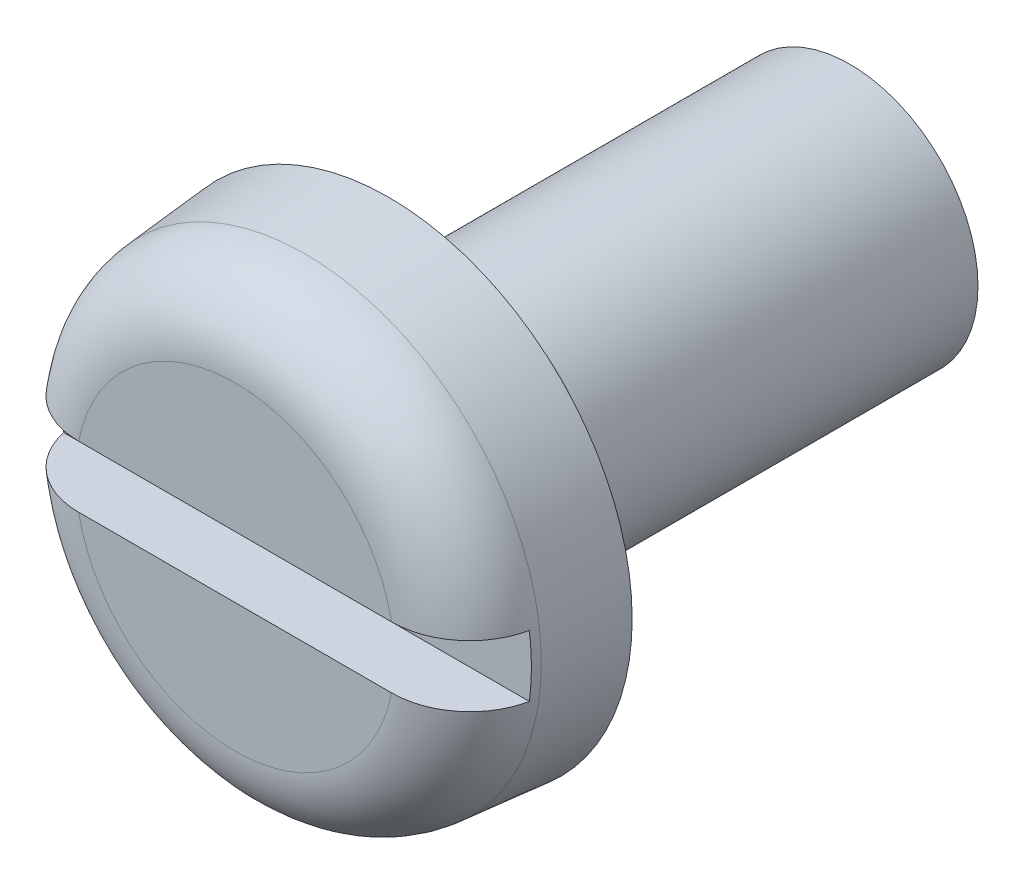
ISO-10303-21;
HEADER;
FILE_DESCRIPTION(('STEP AP214'),'2;1');
FILE_NAME('part.step','',(''),(''),'','','');
FILE_SCHEMA(('AUTOMOTIVE_DESIGN { 1 0 10303 214 1 1 1 1 }'));
ENDSEC;
DATA;
#1=APPLICATION_CONTEXT('core data for automotive mechanical design processes');
#2=APPLICATION_PROTOCOL_DEFINITION('international standard','automotive_design',2000,#1);
#3=PRODUCT_CONTEXT('',#1,'mechanical');
#4=PRODUCT('Part','Part','',(#3));
#5=PRODUCT_RELATED_PRODUCT_CATEGORY('part','',(#4));
#6=PRODUCT_DEFINITION_FORMATION('','',#4);
#7=PRODUCT_DEFINITION_CONTEXT('part definition',#1,'design');
#8=PRODUCT_DEFINITION('design','',#6,#7);
#9=PRODUCT_DEFINITION_SHAPE('','',#8);
#10=(LENGTH_UNIT() NAMED_UNIT(*) SI_UNIT(.MILLI.,.METRE.));
#11=(NAMED_UNIT(*) PLANE_ANGLE_UNIT() SI_UNIT($,.RADIAN.));
#12=(NAMED_UNIT(*) SI_UNIT($,.STERADIAN.) SOLID_ANGLE_UNIT());
#13=UNCERTAINTY_MEASURE_WITH_UNIT(LENGTH_MEASURE(1.E-05),#10,'distance_accuracy_value','');
#14=(GEOMETRIC_REPRESENTATION_CONTEXT(3) GLOBAL_UNCERTAINTY_ASSIGNED_CONTEXT((#13)) GLOBAL_UNIT_ASSIGNED_CONTEXT((#10,
#11,#12)) REPRESENTATION_CONTEXT('',''));
#15=CARTESIAN_POINT('',(0.,0.,0.));
#16=DIRECTION('',(0.,0.,1.));
#17=DIRECTION('',(1.,0.,0.));
#18=AXIS2_PLACEMENT_3D('',#15,#16,#17);
#19=CARTESIAN_POINT('',(0.,0.,-0.2));
#20=DIRECTION('',(0.,0.,1.));
#21=DIRECTION('',(1.,0.,0.));
#22=AXIS2_PLACEMENT_3D('',#19,#20,#21);
#23=TOROIDAL_SURFACE('',#22,2.5,0.2);
#24=CARTESIAN_POINT('',(0.,0.,0.));
#25=DIRECTION('',(0.,0.,1.));
#26=DIRECTION('',(1.,0.,0.));
#27=AXIS2_PLACEMENT_3D('',#24,#25,#26);
#28=CIRCLE('',#27,2.5);
#29=CARTESIAN_POINT('',(2.5,0.,0.));
#30=VERTEX_POINT('',#29);
#31=EDGE_CURVE('E117',#30,#30,#28,.T.);
#32=ORIENTED_EDGE('',*,*,#31,.F.);
#33=EDGE_LOOP('',(#32));
#34=FACE_BOUND('',#33,.T.);
#35=CARTESIAN_POINT('',(0.,0.,-0.228571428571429));
#36=DIRECTION('',(0.,0.,1.));
#37=DIRECTION('',(1.,0.,0.));
#38=AXIS2_PLACEMENT_3D('',#35,#36,#37);
#39=CIRCLE('',#38,2.30205133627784);
#40=CARTESIAN_POINT('',(2.30205133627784,0.,-0.228571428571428));
#41=VERTEX_POINT('',#40);
#42=EDGE_CURVE('E11',#41,#41,#39,.T.);
#43=ORIENTED_EDGE('',*,*,#42,.T.);
#44=EDGE_LOOP('',(#43));
#45=FACE_BOUND('',#44,.T.);
#46=ADVANCED_FACE('F34',(#34,#45),#23,.F.);
#47=CARTESIAN_POINT('',(0.,0.,-1.6));
#48=DIRECTION('',(0.,0.,-1.));
#49=DIRECTION('',(-1.,0.,0.));
#50=AXIS2_PLACEMENT_3D('',#47,#48,#49);
#51=CONICAL_SURFACE('',#50,2.5,0.143347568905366);
#52=ORIENTED_EDGE('',*,*,#42,.F.);
#53=EDGE_LOOP('',(#52));
#54=FACE_BOUND('',#53,.T.);
#55=CARTESIAN_POINT('',(0.,0.,-1.6));
#56=DIRECTION('',(0.,0.,1.));
#57=DIRECTION('',(1.,0.,0.));
#58=AXIS2_PLACEMENT_3D('',#55,#56,#57);
#59=CIRCLE('',#58,2.5);
#60=CARTESIAN_POINT('',(2.5,0.,-1.6));
#61=VERTEX_POINT('',#60);
#62=EDGE_CURVE('E42',#61,#61,#59,.T.);
#63=ORIENTED_EDGE('',*,*,#62,.T.);
#64=EDGE_LOOP('',(#63));
#65=FACE_BOUND('',#64,.T.);
#66=ADVANCED_FACE('F170',(#54,#65),#51,.T.);
#67=CARTESIAN_POINT('',(0.,0.,0.));
#68=DIRECTION('',(0.,0.,1.));
#69=DIRECTION('',(1.,0.,0.));
#70=AXIS2_PLACEMENT_3D('',#67,#68,#69);
#71=CYLINDRICAL_SURFACE('',#70,2.5);
#72=ORIENTED_EDGE('',*,*,#62,.F.);
#73=EDGE_LOOP('',(#72));
#74=FACE_BOUND('',#73,.T.);
#75=CARTESIAN_POINT('',(0.,0.,-9.));
#76=DIRECTION('',(0.,0.,-1.));
#77=DIRECTION('',(-1.,0.,0.));
#78=AXIS2_PLACEMENT_3D('',#75,#76,#77);
#79=CIRCLE('',#78,2.5);
#80=CARTESIAN_POINT('',(-2.5,0.,-9.));
#81=VERTEX_POINT('',#80);
#82=EDGE_CURVE('E161',#81,#81,#79,.T.);
#83=ORIENTED_EDGE('',*,*,#82,.F.);
#84=EDGE_LOOP('',(#83));
#85=FACE_BOUND('',#84,.T.);
#86=ADVANCED_FACE('F167',(#74,#85),#71,.T.);
#87=CARTESIAN_POINT('',(0.,-4.75,0.));
#88=DIRECTION('',(0.,0.,-1.));
#89=DIRECTION('',(-1.,0.,0.));
#90=AXIS2_PLACEMENT_3D('',#87,#88,#89);
#91=PLANE('',#90);
#92=CARTESIAN_POINT('',(0.,0.,0.));
#93=DIRECTION('',(0.,0.,1.));
#94=DIRECTION('',(1.,0.,0.));
#95=AXIS2_PLACEMENT_3D('',#92,#93,#94);
#96=CIRCLE('',#95,4.75);
#97=CARTESIAN_POINT('',(4.75,0.,0.));
#98=VERTEX_POINT('',#97);
#99=EDGE_CURVE('E144',#98,#98,#96,.T.);
#100=ORIENTED_EDGE('',*,*,#99,.F.);
#101=EDGE_LOOP('',(#100));
#102=FACE_BOUND('',#101,.T.);
#103=ORIENTED_EDGE('',*,*,#31,.T.);
#104=EDGE_LOOP('',(#103));
#105=FACE_BOUND('',#104,.T.);
#106=ADVANCED_FACE('F169',(#102,#105),#91,.T.);
#107=CARTESIAN_POINT('',(0.,-3.11303724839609,3.));
#108=DIRECTION('',(0.,0.,-1.));
#109=DIRECTION('',(-1.,0.,0.));
#110=AXIS2_PLACEMENT_3D('',#107,#108,#109);
#111=PLANE('',#110);
#112=CARTESIAN_POINT('',(0.,0.,3.));
#113=DIRECTION('',(0.,0.,1.));
#114=DIRECTION('',(1.,0.,0.));
#115=AXIS2_PLACEMENT_3D('',#112,#113,#114);
#116=CIRCLE('',#115,3.11303724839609);
#117=CARTESIAN_POINT('',(-3.05466870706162,-0.6,3.));
#118=VERTEX_POINT('',#117);
#119=CARTESIAN_POINT('',(3.05466870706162,-0.6,3.));
#120=VERTEX_POINT('',#119);
#121=EDGE_CURVE('E150',#118,#120,#116,.T.);
#122=ORIENTED_EDGE('',*,*,#121,.T.);
#123=DIRECTION('',(1.,0.,0.));
#124=VECTOR('',#123,1.);
#125=CARTESIAN_POINT('',(-4.75,-0.6,3.));
#126=LINE('',#125,#124);
#127=EDGE_CURVE('E65',#118,#120,#126,.T.);
#128=ORIENTED_EDGE('',*,*,#127,.F.);
#129=EDGE_LOOP('',(#122,#128));
#130=FACE_BOUND('',#129,.T.);
#131=ADVANCED_FACE('F177',(#130),#111,.F.);
#132=CARTESIAN_POINT('',(0.,0.,0.));
#133=DIRECTION('',(0.,0.,-1.));
#134=DIRECTION('',(-1.,0.,0.));
#135=AXIS2_PLACEMENT_3D('',#132,#133,#134);
#136=CONICAL_SURFACE('',#135,4.75,0.0872664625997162);
#137=CARTESIAN_POINT('',(0.,0.,1.63073361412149));
#138=DIRECTION('',(0.,0.,1.));
#139=DIRECTION('',(1.,0.,0.));
#140=AXIS2_PLACEMENT_3D('',#137,#138,#139);
#141=CIRCLE('',#140,4.60732929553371);
#142=CARTESIAN_POINT('',(4.60732929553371,0.,1.63073361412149));
#143=VERTEX_POINT('',#142);
#144=EDGE_CURVE('E151',#143,#143,#141,.T.);
#145=ORIENTED_EDGE('',*,*,#144,.F.);
#146=EDGE_LOOP('',(#145));
#147=FACE_BOUND('',#146,.T.);
#148=ORIENTED_EDGE('',*,*,#99,.T.);
#149=EDGE_LOOP('',(#148));
#150=FACE_BOUND('',#149,.T.);
#151=ADVANCED_FACE('F225',(#147,#150),#136,.T.);
#152=CARTESIAN_POINT('',(3.05466870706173,0.6,3.));
#153=VERTEX_POINT('',#152);
#154=CARTESIAN_POINT('',(-3.05466870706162,0.6,3.));
#155=VERTEX_POINT('',#154);
#156=EDGE_CURVE('E110',#153,#155,#116,.T.);
#157=ORIENTED_EDGE('',*,*,#156,.T.);
#158=DIRECTION('',(1.,0.,0.));
#159=VECTOR('',#158,1.);
#160=CARTESIAN_POINT('',(-4.75,0.6,3.));
#161=LINE('',#160,#159);
#162=EDGE_CURVE('E104',#155,#153,#161,.T.);
#163=ORIENTED_EDGE('',*,*,#162,.T.);
#164=EDGE_LOOP('',(#157,#163));
#165=FACE_BOUND('',#164,.T.);
#166=ADVANCED_FACE('F227',(#165),#111,.F.);
#167=CARTESIAN_POINT('',(0.,0.,1.5));
#168=DIRECTION('',(0.,0.,1.));
#169=DIRECTION('',(1.,0.,0.));
#170=AXIS2_PLACEMENT_3D('',#167,#168,#169);
#171=TOROIDAL_SURFACE('',#170,3.11303724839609,1.5);
#172=CARTESIAN_POINT('',(1.78444467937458,-0.6,2.35794138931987));
#173=CARTESIAN_POINT('',(1.83690352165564,-0.6,2.42924707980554));
#174=CARTESIAN_POINT('',(1.8955755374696,-0.6,2.49608392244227));
#175=CARTESIAN_POINT('',(2.02337981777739,-0.6,2.61902622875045));
#176=CARTESIAN_POINT('',(2.09253096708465,-0.6,2.67511189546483));
#177=CARTESIAN_POINT('',(2.23912059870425,-0.6,2.77492489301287));
#178=CARTESIAN_POINT('',(2.31654826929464,-0.6,2.81866808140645));
#179=CARTESIAN_POINT('',(2.47756798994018,-0.6,2.89264178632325));
#180=CARTESIAN_POINT('',(2.56115732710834,-0.6,2.92287820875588));
#181=CARTESIAN_POINT('',(2.73293900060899,-0.6,2.96912896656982));
#182=CARTESIAN_POINT('',(2.82116384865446,-0.6,2.98502287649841));
#183=CARTESIAN_POINT('',(2.99904386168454,-0.6,3.00155670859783));
#184=CARTESIAN_POINT('',(3.08869907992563,-0.6,3.00219606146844));
#185=CARTESIAN_POINT('',(3.26558059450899,-0.6,2.98814682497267));
#186=CARTESIAN_POINT('',(3.35282334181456,-0.6,2.97366589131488));
#187=CARTESIAN_POINT('',(3.52354291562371,-0.6,2.92998057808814));
#188=CARTESIAN_POINT('',(3.60702014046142,-0.6,2.90077775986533));
#189=CARTESIAN_POINT('',(3.76619303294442,-0.6,2.82907393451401));
#190=CARTESIAN_POINT('',(3.8420041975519,-0.6,2.78682927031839));
#191=CARTESIAN_POINT('',(3.98530836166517,-0.6,2.69002408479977));
#192=CARTESIAN_POINT('',(4.05280208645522,-0.6,2.63546463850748));
#193=CARTESIAN_POINT('',(4.17647632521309,-0.6,2.51649131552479));
#194=CARTESIAN_POINT('',(4.23281374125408,-0.6,2.45224049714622));
#195=CARTESIAN_POINT('',(4.33376627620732,-0.6,2.31510841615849));
#196=CARTESIAN_POINT('',(4.37838209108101,-0.6,2.24222766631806));
#197=CARTESIAN_POINT('',(4.4541578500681,-0.6,2.09072248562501));
#198=CARTESIAN_POINT('',(4.4854521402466,-0.6,2.01216522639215));
#199=CARTESIAN_POINT('',(4.53432193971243,-0.6,1.85089373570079));
#200=CARTESIAN_POINT('',(4.55189796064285,-0.6,1.7681796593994));
#201=CARTESIAN_POINT('',(4.57274942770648,-0.6,1.60145125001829));
#202=CARTESIAN_POINT('',(4.57610622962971,-0.6,1.51744708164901));
#203=CARTESIAN_POINT('',(4.56864397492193,-0.6,1.35007159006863));
#204=CARTESIAN_POINT('',(4.55782514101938,-0.6,1.26670025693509));
#205=CARTESIAN_POINT('',(4.52235909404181,-0.6,1.10309443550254));
#206=CARTESIAN_POINT('',(4.49773409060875,-0.6,1.02285512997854));
#207=CARTESIAN_POINT('',(4.43539277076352,-0.6,0.867636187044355));
#208=CARTESIAN_POINT('',(4.39767641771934,-0.6,0.79265656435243));
#209=CARTESIAN_POINT('',(4.31014761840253,-0.6,0.649886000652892));
#210=CARTESIAN_POINT('',(4.26030712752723,-0.6,0.58211225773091));
#211=CARTESIAN_POINT('',(4.15002218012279,-0.6,0.455828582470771));
#212=CARTESIAN_POINT('',(4.0895774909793,-0.6,0.397318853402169));
#213=CARTESIAN_POINT('',(3.95939810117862,-0.6,0.290802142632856));
#214=CARTESIAN_POINT('',(3.88960598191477,-0.6,0.242865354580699));
#215=CARTESIAN_POINT('',(3.7430351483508,-0.6,0.15924465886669));
#216=CARTESIAN_POINT('',(3.66625613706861,-0.6,0.123561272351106));
#217=CARTESIAN_POINT('',(3.5069992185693,-0.6,0.0650186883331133));
#218=CARTESIAN_POINT('',(3.42446799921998,-0.6,0.0423045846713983));
#219=CARTESIAN_POINT('',(3.25679047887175,-0.6,0.0108239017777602));
#220=CARTESIAN_POINT('',(3.17164399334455,-0.6,0.00205830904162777));
#221=CARTESIAN_POINT('',(2.99973325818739,-0.6,-0.00144063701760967));
#222=CARTESIAN_POINT('',(2.9129645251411,-0.6,0.00404749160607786));
#223=CARTESIAN_POINT('',(2.74151789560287,-0.6,0.0292395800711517));
#224=CARTESIAN_POINT('',(2.65684020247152,-0.6,0.0489449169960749));
#225=CARTESIAN_POINT('',(2.49032583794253,-0.6,0.10241437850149));
#226=CARTESIAN_POINT('',(2.40856994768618,-0.6,0.136430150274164));
#227=CARTESIAN_POINT('',(2.25181146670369,-0.6,0.217532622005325));
#228=CARTESIAN_POINT('',(2.17680984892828,-0.6,0.264621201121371));
#229=CARTESIAN_POINT('',(2.03476656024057,-0.6,0.371261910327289));
#230=CARTESIAN_POINT('',(1.9678365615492,-0.6,0.430962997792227));
#231=CARTESIAN_POINT('',(1.84509773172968,-0.6,0.560904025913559));
#232=CARTESIAN_POINT('',(1.78928972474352,-0.6,0.631144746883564));
#233=CARTESIAN_POINT('',(1.69151599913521,-0.6,0.779227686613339));
#234=CARTESIAN_POINT('',(1.64935982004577,-0.6,0.856943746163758));
#235=CARTESIAN_POINT('',(1.57962775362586,-0.6,1.01865372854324));
#236=CARTESIAN_POINT('',(1.55204276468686,-0.6,1.10264369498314));
#237=CARTESIAN_POINT('',(1.51405337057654,-0.6,1.26925299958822));
#238=CARTESIAN_POINT('',(1.50273689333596,-0.6,1.35166422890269));
#239=CARTESIAN_POINT('',(1.49493998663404,-0.6,1.51719840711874));
#240=CARTESIAN_POINT('',(1.49845862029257,-0.6,1.60032131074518));
#241=CARTESIAN_POINT('',(1.5195684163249,-0.6,1.76045042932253));
#242=CARTESIAN_POINT('',(1.53644040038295,-0.6,1.83755362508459));
#243=CARTESIAN_POINT('',(1.58254863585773,-0.6,1.98789309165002));
#244=CARTESIAN_POINT('',(1.61177190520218,-0.6,2.06113333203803));
#245=CARTESIAN_POINT('',(1.6661558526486,-0.6,2.17122521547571));
#246=CARTESIAN_POINT('',(1.68752043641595,-0.6,2.21000400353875));
#247=CARTESIAN_POINT('',(1.73355428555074,-0.6,2.28554106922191));
#248=CARTESIAN_POINT('',(1.75822331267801,-0.6,2.32229949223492));
#249=CARTESIAN_POINT('',(1.78444467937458,-0.6,2.35794138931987));
#250=B_SPLINE_CURVE_WITH_KNOTS('',3,(#172,#173,#174,#175,#176,#177,#178,#179,#180,#181,#182,
#183,#184,#185,#186,#187,#188,#189,#190,#191,#192,#193,#194,#195,#196,#197,#198,#199,#200,#201,
#202,#203,#204,#205,#206,#207,#208,#209,#210,#211,#212,#213,#214,#215,#216,#217,#218,#219,#220,
#221,#222,#223,#224,#225,#226,#227,#228,#229,#230,#231,#232,#233,#234,#235,#236,#237,#238,#239,
#240,#241,#242,#243,#244,#245,#246,#247,#248,#249),.UNSPECIFIED.,.T.,.F.,(4,2,2,2,2,2,2,2,2,2,2,
2,2,2,2,2,2,2,2,2,2,2,2,2,2,2,2,2,2,2,2,2,2,2,2,2,2,2,4),(0.,0.26540428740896,0.531292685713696,
0.796837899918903,1.06226688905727,1.329904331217,1.59755176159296,1.86157117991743,
2.12556260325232,2.3846640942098,2.64374297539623,2.89886888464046,3.15397964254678,
3.40645291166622,3.65891676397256,3.90993416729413,4.16094762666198,4.41155844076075,
4.66216995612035,4.9133667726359,5.16456910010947,5.41739205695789,5.67022576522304,
5.92583525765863,6.18146282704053,6.44108615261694,6.70073462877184,6.96515356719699,
7.22961053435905,7.49738541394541,7.76518012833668,8.02905935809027,8.29277356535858,
8.54103382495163,8.78927840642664,9.02499451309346,9.26046347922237,9.39313443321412,
9.52579582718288),.UNSPECIFIED.);
#251=CARTESIAN_POINT('',(4.54328342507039,-0.6,1.8));
#252=VERTEX_POINT('',#251);
#253=EDGE_CURVE('E112',#120,#252,#250,.T.);
#254=ORIENTED_EDGE('',*,*,#253,.F.);
#255=ORIENTED_EDGE('',*,*,#121,.F.);
#256=CARTESIAN_POINT('',(-4.16448807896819,-0.6,2.52575634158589));
#257=CARTESIAN_POINT('',(-4.10593108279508,-0.6,2.58759040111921));
#258=CARTESIAN_POINT('',(-4.04205754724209,-0.6,2.64448315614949));
#259=CARTESIAN_POINT('',(-3.90557965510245,-0.6,2.74673868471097));
#260=CARTESIAN_POINT('',(-3.8329636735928,-0.6,2.79208585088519));
#261=CARTESIAN_POINT('',(-3.6812385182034,-0.6,2.86993634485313));
#262=CARTESIAN_POINT('',(-3.60213624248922,-0.6,2.90245310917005));
#263=CARTESIAN_POINT('',(-3.43965944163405,-0.6,2.95388684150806));
#264=CARTESIAN_POINT('',(-3.35628600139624,-0.6,2.97280724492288));
#265=CARTESIAN_POINT('',(-3.18666752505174,-0.6,2.99679128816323));
#266=CARTESIAN_POINT('',(-3.10040138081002,-0.6,3.00170544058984));
#267=CARTESIAN_POINT('',(-2.92823768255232,-0.6,2.99724984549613));
#268=CARTESIAN_POINT('',(-2.84234017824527,-0.6,2.98787822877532));
#269=CARTESIAN_POINT('',(-2.67171740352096,-0.6,2.95493830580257));
#270=CARTESIAN_POINT('',(-2.58704058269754,-0.6,2.93111906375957));
#271=CARTESIAN_POINT('',(-2.4227747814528,-0.6,2.86983644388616));
#272=CARTESIAN_POINT('',(-2.34318639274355,-0.6,2.83237148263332));
#273=CARTESIAN_POINT('',(-2.19000637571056,-0.6,2.74414265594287));
#274=CARTESIAN_POINT('',(-2.11653425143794,-0.6,2.69317111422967));
#275=CARTESIAN_POINT('',(-1.97917572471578,-0.6,2.57960096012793));
#276=CARTESIAN_POINT('',(-1.9152908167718,-0.6,2.51700053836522));
#277=CARTESIAN_POINT('',(-1.79922493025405,-0.6,2.38190312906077));
#278=CARTESIAN_POINT('',(-1.74702578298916,-0.6,2.30942179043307));
#279=CARTESIAN_POINT('',(-1.65617143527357,-0.6,2.15640604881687));
#280=CARTESIAN_POINT('',(-1.61751169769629,-0.6,2.07587435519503));
#281=CARTESIAN_POINT('',(-1.55688948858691,-0.6,1.91273839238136));
#282=CARTESIAN_POINT('',(-1.53427068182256,-0.6,1.83037882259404));
#283=CARTESIAN_POINT('',(-1.50426955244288,-0.6,1.66294547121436));
#284=CARTESIAN_POINT('',(-1.49687837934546,-0.6,1.57787329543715));
#285=CARTESIAN_POINT('',(-1.4977182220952,-0.6,1.41331484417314));
#286=CARTESIAN_POINT('',(-1.50497326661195,-0.6,1.33382186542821));
#287=CARTESIAN_POINT('',(-1.53279061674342,-0.6,1.17720481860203));
#288=CARTESIAN_POINT('',(-1.55335401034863,-0.6,1.10008094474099));
#289=CARTESIAN_POINT('',(-1.60674103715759,-0.6,0.950510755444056));
#290=CARTESIAN_POINT('',(-1.63952477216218,-0.6,0.878050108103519));
#291=CARTESIAN_POINT('',(-1.7161028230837,-0.6,0.739209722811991));
#292=CARTESIAN_POINT('',(-1.75989979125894,-0.6,0.672831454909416));
#293=CARTESIAN_POINT('',(-1.86010993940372,-0.6,0.54375216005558));
#294=CARTESIAN_POINT('',(-1.91712921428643,-0.6,0.48152158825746));
#295=CARTESIAN_POINT('',(-2.04035161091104,-0.6,0.366934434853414));
#296=CARTESIAN_POINT('',(-2.10655695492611,-0.6,0.314580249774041));
#297=CARTESIAN_POINT('',(-2.24995520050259,-0.6,0.218621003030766));
#298=CARTESIAN_POINT('',(-2.32753422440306,-0.6,0.175591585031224));
#299=CARTESIAN_POINT('',(-2.48876491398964,-0.6,0.103010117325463));
#300=CARTESIAN_POINT('',(-2.57241708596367,-0.6,0.0734591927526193));
#301=CARTESIAN_POINT('',(-2.74436421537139,-0.6,0.0285216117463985));
#302=CARTESIAN_POINT('',(-2.83269773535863,-0.6,0.0132820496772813));
#303=CARTESIAN_POINT('',(-3.0106737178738,-0.6,-0.00192802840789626));
#304=CARTESIAN_POINT('',(-3.10031610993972,-0.6,-0.00189936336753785));
#305=CARTESIAN_POINT('',(-3.27703669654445,-0.6,0.0134667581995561));
#306=CARTESIAN_POINT('',(-3.36413320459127,-0.6,0.0285931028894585));
#307=CARTESIAN_POINT('',(-3.53445278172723,-0.6,0.0735345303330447));
#308=CARTESIAN_POINT('',(-3.61767622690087,-0.6,0.103348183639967));
#309=CARTESIAN_POINT('',(-3.7762470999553,-0.6,0.176209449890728));
#310=CARTESIAN_POINT('',(-3.8517117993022,-0.6,0.219001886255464));
#311=CARTESIAN_POINT('',(-3.99423591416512,-0.6,0.316834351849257));
#312=CARTESIAN_POINT('',(-4.06129603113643,-0.6,0.371873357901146));
#313=CARTESIAN_POINT('',(-4.18404243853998,-0.6,0.491722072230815));
#314=CARTESIAN_POINT('',(-4.23988572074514,-0.6,0.556371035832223));
#315=CARTESIAN_POINT('',(-4.33979100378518,-0.6,0.694208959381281));
#316=CARTESIAN_POINT('',(-4.38385368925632,-0.6,0.767397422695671));
#317=CARTESIAN_POINT('',(-4.45849174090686,-0.6,0.919425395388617));
#318=CARTESIAN_POINT('',(-4.48920025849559,-0.6,0.998199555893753));
#319=CARTESIAN_POINT('',(-4.53687031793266,-0.6,1.159799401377));
#320=CARTESIAN_POINT('',(-4.55383292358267,-0.6,1.24262477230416));
#321=CARTESIAN_POINT('',(-4.57345374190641,-0.6,1.40946823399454));
#322=CARTESIAN_POINT('',(-4.5761935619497,-0.6,1.49347674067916));
#323=CARTESIAN_POINT('',(-4.56750581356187,-0.6,1.66078113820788));
#324=CARTESIAN_POINT('',(-4.55607478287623,-0.6,1.74407684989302));
#325=CARTESIAN_POINT('',(-4.51940184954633,-0.6,1.90747064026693));
#326=CARTESIAN_POINT('',(-4.49417405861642,-0.6,1.98757189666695));
#327=CARTESIAN_POINT('',(-4.43067007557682,-0.6,2.14234114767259));
#328=CARTESIAN_POINT('',(-4.39241024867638,-0.6,2.21701581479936));
#329=CARTESIAN_POINT('',(-4.32168602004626,-0.6,2.33052120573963));
#330=CARTESIAN_POINT('',(-4.29300657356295,-0.6,2.37175930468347));
#331=CARTESIAN_POINT('',(-4.23166298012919,-0.6,2.45115580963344));
#332=CARTESIAN_POINT('',(-4.1989988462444,-0.6,2.48931422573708));
#333=CARTESIAN_POINT('',(-4.16448807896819,-0.6,2.52575634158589));
#334=B_SPLINE_CURVE_WITH_KNOTS('',3,(#256,#257,#258,#259,#260,#261,#262,#263,#264,#265,#266,
#267,#268,#269,#270,#271,#272,#273,#274,#275,#276,#277,#278,#279,#280,#281,#282,#283,#284,#285,
#286,#287,#288,#289,#290,#291,#292,#293,#294,#295,#296,#297,#298,#299,#300,#301,#302,#303,#304,
#305,#306,#307,#308,#309,#310,#311,#312,#313,#314,#315,#316,#317,#318,#319,#320,#321,#322,#323,
#324,#325,#326,#327,#328,#329,#330,#331,#332,#333),.UNSPECIFIED.,.T.,.F.,(4,2,2,2,2,2,2,2,2,2,2,
2,2,2,2,2,2,2,2,2,2,2,2,2,2,2,2,2,2,2,2,2,2,2,2,2,2,2,4),(0.,0.255296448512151,
0.510936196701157,0.76630751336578,1.02161428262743,1.27963589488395,1.5376912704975,
1.8003624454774,2.06306411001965,2.33006648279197,2.59711043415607,2.8637362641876,
3.13027266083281,3.38515155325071,3.63988226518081,3.87819866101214,4.11653454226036,
4.35409900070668,4.59172072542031,4.84382021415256,5.09598079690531,5.36088081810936,
5.62580294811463,5.89341910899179,6.16102091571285,6.42493252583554,6.68881845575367,
6.94781983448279,7.20679958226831,7.46185384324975,7.71689327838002,7.96932796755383,
8.22174311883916,8.47270835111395,8.72373491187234,8.97450519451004,9.22496172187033,
9.37542205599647,9.52588189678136),.UNSPECIFIED.);
#335=CARTESIAN_POINT('',(-4.54328342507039,-0.6,1.8));
#336=VERTEX_POINT('',#335);
#337=EDGE_CURVE('E94',#336,#118,#334,.T.);
#338=ORIENTED_EDGE('',*,*,#337,.F.);
#339=CARTESIAN_POINT('',(0.,0.,1.8));
#340=DIRECTION('',(0.,0.,-1.));
#341=DIRECTION('',(-1.,0.,0.));
#342=AXIS2_PLACEMENT_3D('',#339,#340,#341);
#343=CIRCLE('',#342,4.582731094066);
#344=CARTESIAN_POINT('',(-4.54328342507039,0.6,1.8));
#345=VERTEX_POINT('',#344);
#346=EDGE_CURVE('E96',#345,#336,#343,.F.);
#347=ORIENTED_EDGE('',*,*,#346,.F.);
#348=CARTESIAN_POINT('',(-4.16448807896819,0.6,2.52575634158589));
#349=CARTESIAN_POINT('',(-4.2222007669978,0.6,2.46480270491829));
#350=CARTESIAN_POINT('',(-4.27483380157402,0.6,2.3989590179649));
#351=CARTESIAN_POINT('',(-4.36835495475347,0.6,2.25932438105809));
#352=CARTESIAN_POINT('',(-4.40922990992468,0.6,2.18552465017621));
#353=CARTESIAN_POINT('',(-4.47797693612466,0.6,2.0321094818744));
#354=CARTESIAN_POINT('',(-4.50585200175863,0.6,1.95249538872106));
#355=CARTESIAN_POINT('',(-4.54777716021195,0.6,1.78972713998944));
#356=CARTESIAN_POINT('',(-4.56183052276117,0.6,1.70657382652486));
#357=CARTESIAN_POINT('',(-4.57568541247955,0.6,1.53938213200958));
#358=CARTESIAN_POINT('',(-4.57553672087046,0.6,1.45534787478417));
#359=CARTESIAN_POINT('',(-4.56111544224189,0.6,1.28849842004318));
#360=CARTESIAN_POINT('',(-4.54684255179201,0.6,1.20568324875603));
#361=CARTESIAN_POINT('',(-4.5046163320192,0.6,1.04371892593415));
#362=CARTESIAN_POINT('',(-4.47667847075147,0.6,0.964565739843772));
#363=CARTESIAN_POINT('',(-4.40794662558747,0.6,0.812055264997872));
#364=CARTESIAN_POINT('',(-4.3671525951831,0.6,0.738697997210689));
#365=CARTESIAN_POINT('',(-4.27376142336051,0.6,0.599626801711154));
#366=CARTESIAN_POINT('',(-4.2211312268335,0.6,0.533935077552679));
#367=CARTESIAN_POINT('',(-4.10565865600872,0.6,0.412245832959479));
#368=CARTESIAN_POINT('',(-4.04281605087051,0.6,0.356248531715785));
#369=CARTESIAN_POINT('',(-3.90824759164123,0.6,0.255100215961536));
#370=CARTESIAN_POINT('',(-3.83646274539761,0.6,0.210027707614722));
#371=CARTESIAN_POINT('',(-3.68641296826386,0.6,0.132418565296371));
#372=CARTESIAN_POINT('',(-3.60814773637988,0.6,0.0998825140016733));
#373=CARTESIAN_POINT('',(-3.44640006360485,0.6,0.0478448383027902));
#374=CARTESIAN_POINT('',(-3.36286776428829,0.6,0.0284982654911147));
#375=CARTESIAN_POINT('',(-3.19375865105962,0.6,0.00386379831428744));
#376=CARTESIAN_POINT('',(-3.10818168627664,0.6,-0.00142305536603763));
#377=CARTESIAN_POINT('',(-2.93593785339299,0.6,0.00210511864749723));
#378=CARTESIAN_POINT('',(-2.84927570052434,0.6,0.0111492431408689));
#379=CARTESIAN_POINT('',(-2.67862588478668,0.6,0.0433870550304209));
#380=CARTESIAN_POINT('',(-2.59463849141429,0.6,0.066582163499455));
#381=CARTESIAN_POINT('',(-2.43009011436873,0.6,0.126940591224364));
#382=CARTESIAN_POINT('',(-2.34962013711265,0.6,0.164352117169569));
#383=CARTESIAN_POINT('',(-2.19599172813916,0.6,0.252010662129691));
#384=CARTESIAN_POINT('',(-2.12283440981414,0.6,0.302259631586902));
#385=CARTESIAN_POINT('',(-1.98517825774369,0.6,0.414847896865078));
#386=CARTESIAN_POINT('',(-1.9207797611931,0.6,0.477310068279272));
#387=CARTESIAN_POINT('',(-1.80360821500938,0.6,0.612352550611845));
#388=CARTESIAN_POINT('',(-1.75083532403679,0.6,0.68493299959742));
#389=CARTESIAN_POINT('',(-1.65981326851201,0.6,0.836758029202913));
#390=CARTESIAN_POINT('',(-1.62129637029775,0.6,0.915841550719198));
#391=CARTESIAN_POINT('',(-1.55909823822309,0.6,1.07963318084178));
#392=CARTESIAN_POINT('',(-1.53540769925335,0.6,1.16433772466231));
#393=CARTESIAN_POINT('',(-1.50512561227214,0.6,1.33131492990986));
#394=CARTESIAN_POINT('',(-1.4975631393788,0.6,1.41341170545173));
#395=CARTESIAN_POINT('',(-1.49703912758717,0.6,1.57764133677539));
#396=CARTESIAN_POINT('',(-1.50407401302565,0.6,1.65977417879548));
#397=CARTESIAN_POINT('',(-1.53172166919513,0.6,1.81799943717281));
#398=CARTESIAN_POINT('',(-1.55172937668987,0.6,1.89419910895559));
#399=CARTESIAN_POINT('',(-1.60381093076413,0.6,2.04235033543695));
#400=CARTESIAN_POINT('',(-1.63588728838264,0.6,2.11430100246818));
#401=CARTESIAN_POINT('',(-1.71223681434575,0.6,2.25475429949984));
#402=CARTESIAN_POINT('',(-1.75690511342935,0.6,2.3230416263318));
#403=CARTESIAN_POINT('',(-1.85641398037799,0.6,2.45174681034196));
#404=CARTESIAN_POINT('',(-1.91125716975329,0.6,2.51216263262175));
#405=CARTESIAN_POINT('',(-2.03339957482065,0.6,2.62739536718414));
#406=CARTESIAN_POINT('',(-2.10127142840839,0.6,2.68160626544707));
#407=CARTESIAN_POINT('',(-2.24492747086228,0.6,2.77827829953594));
#408=CARTESIAN_POINT('',(-2.32071308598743,0.6,2.82073731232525));
#409=CARTESIAN_POINT('',(-2.48060945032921,0.6,2.89387356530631));
#410=CARTESIAN_POINT('',(-2.56490423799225,0.6,2.92414954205));
#411=CARTESIAN_POINT('',(-2.73739364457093,0.6,2.97005194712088));
#412=CARTESIAN_POINT('',(-2.82558812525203,0.6,2.98567889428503));
#413=CARTESIAN_POINT('',(-3.00295249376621,0.6,3.00166405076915));
#414=CARTESIAN_POINT('',(-3.0921161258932,0.6,3.00209133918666));
#415=CARTESIAN_POINT('',(-3.26923006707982,0.6,2.98768467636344));
#416=CARTESIAN_POINT('',(-3.35718016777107,0.6,2.97284813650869));
#417=CARTESIAN_POINT('',(-3.52770551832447,0.6,2.92860575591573));
#418=CARTESIAN_POINT('',(-3.61034739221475,0.6,2.89945615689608));
#419=CARTESIAN_POINT('',(-3.76935382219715,0.6,2.82746738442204));
#420=CARTESIAN_POINT('',(-3.84572657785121,0.6,2.78464646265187));
#421=CARTESIAN_POINT('',(-3.96252994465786,0.6,2.70518941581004));
#422=CARTESIAN_POINT('',(-4.00560511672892,0.6,2.67236876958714));
#423=CARTESIAN_POINT('',(-4.08798619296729,0.6,2.60229457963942));
#424=CARTESIAN_POINT('',(-4.12729213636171,0.6,2.56504108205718));
#425=CARTESIAN_POINT('',(-4.16448807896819,0.6,2.52575634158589));
#426=B_SPLINE_CURVE_WITH_KNOTS('',3,(#348,#349,#350,#351,#352,#353,#354,#355,#356,#357,#358,
#359,#360,#361,#362,#363,#364,#365,#366,#367,#368,#369,#370,#371,#372,#373,#374,#375,#376,#377,
#378,#379,#380,#381,#382,#383,#384,#385,#386,#387,#388,#389,#390,#391,#392,#393,#394,#395,#396,
#397,#398,#399,#400,#401,#402,#403,#404,#405,#406,#407,#408,#409,#410,#411,#412,#413,#414,#415,
#416,#417,#418,#419,#420,#421,#422,#423,#424,#425),.UNSPECIFIED.,.T.,.F.,(4,2,2,2,2,2,2,2,2,2,2,
2,2,2,2,2,2,2,2,2,2,2,2,2,2,2,2,2,2,2,2,2,2,2,2,2,2,2,4),(0.,0.251627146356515,
0.503534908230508,0.755384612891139,1.00717472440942,1.25808229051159,1.50899524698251,
1.7596248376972,2.01025533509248,2.26159466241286,2.51293967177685,2.76604060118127,
3.01915329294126,3.27519243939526,3.53125053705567,3.79144347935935,4.05166255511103,
4.31665070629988,4.5816791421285,4.84952563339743,5.11737577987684,5.37990411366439,
5.64226751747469,5.88833003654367,6.13433228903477,6.36961414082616,6.60494497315,
6.84869102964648,7.09249997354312,7.35191672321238,7.61138030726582,7.87880123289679,
8.14621268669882,8.41240865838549,8.67864978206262,8.94028930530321,9.20158098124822,
9.36375686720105,9.52593106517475),.UNSPECIFIED.);
#427=EDGE_CURVE('E101',#155,#345,#426,.T.);
#428=ORIENTED_EDGE('',*,*,#427,.F.);
#429=ORIENTED_EDGE('',*,*,#156,.F.);
#430=CARTESIAN_POINT('',(1.78444467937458,0.6,2.35794138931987));
#431=CARTESIAN_POINT('',(1.73578880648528,0.6,2.29179696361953));
#432=CARTESIAN_POINT('',(1.69241067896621,0.6,2.22172063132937));
#433=CARTESIAN_POINT('',(1.61775076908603,0.6,2.07533867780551));
#434=CARTESIAN_POINT('',(1.5864751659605,0.6,1.99902989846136));
#435=CARTESIAN_POINT('',(1.53733532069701,0.6,1.84198248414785));
#436=CARTESIAN_POINT('',(1.51950238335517,0.6,1.76123397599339));
#437=CARTESIAN_POINT('',(1.49831173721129,0.6,1.59787800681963));
#438=CARTESIAN_POINT('',(1.49494759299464,0.6,1.51527138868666));
#439=CARTESIAN_POINT('',(1.50270631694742,0.6,1.35404016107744));
#440=CARTESIAN_POINT('',(1.51326068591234,0.6,1.27538742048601));
#441=CARTESIAN_POINT('',(1.54733501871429,0.6,1.12094605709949));
#442=CARTESIAN_POINT('',(1.57085729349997,0.6,1.04515794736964));
#443=CARTESIAN_POINT('',(1.63005609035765,0.6,0.897825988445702));
#444=CARTESIAN_POINT('',(1.66582579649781,0.6,0.826319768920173));
#445=CARTESIAN_POINT('',(1.74815983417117,0.6,0.689827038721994));
#446=CARTESIAN_POINT('',(1.79472677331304,0.6,0.624842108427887));
#447=CARTESIAN_POINT('',(1.90052230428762,0.6,0.498889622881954));
#448=CARTESIAN_POINT('',(1.96036731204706,0.6,0.438439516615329));
#449=CARTESIAN_POINT('',(2.08896077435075,0.6,0.327892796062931));
#450=CARTESIAN_POINT('',(2.1577112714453,0.6,0.277798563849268));
#451=CARTESIAN_POINT('',(2.30563751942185,0.6,0.187152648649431));
#452=CARTESIAN_POINT('',(2.3851467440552,0.6,0.147143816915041));
#453=CARTESIAN_POINT('',(2.54972911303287,0.6,0.0809456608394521));
#454=CARTESIAN_POINT('',(2.63480260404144,0.6,0.0547571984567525));
#455=CARTESIAN_POINT('',(2.80866920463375,0.6,0.0169288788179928));
#456=CARTESIAN_POINT('',(2.8974815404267,0.6,0.00537709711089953));
#457=CARTESIAN_POINT('',(3.07577878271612,0.6,-0.00240662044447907));
#458=CARTESIAN_POINT('',(3.16526364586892,0.6,0.00136046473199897));
#459=CARTESIAN_POINT('',(3.34090743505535,0.6,0.02407566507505));
#460=CARTESIAN_POINT('',(3.42709622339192,0.6,0.0427925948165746));
#461=CARTESIAN_POINT('',(3.59499998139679,0.6,0.0947043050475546));
#462=CARTESIAN_POINT('',(3.67671538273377,0.6,0.127897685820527));
#463=CARTESIAN_POINT('',(3.83175947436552,0.6,0.207148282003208));
#464=CARTESIAN_POINT('',(3.90521449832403,0.6,0.252958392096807));
#465=CARTESIAN_POINT('',(4.04323981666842,0.6,0.356432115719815));
#466=CARTESIAN_POINT('',(4.10781084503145,0.6,0.414094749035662));
#467=CARTESIAN_POINT('',(4.22525214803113,0.6,0.53871672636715));
#468=CARTESIAN_POINT('',(4.27827922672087,0.6,0.605528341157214));
#469=CARTESIAN_POINT('',(4.37223374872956,0.6,0.747177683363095));
#470=CARTESIAN_POINT('',(4.41316188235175,0.6,0.822014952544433));
#471=CARTESIAN_POINT('',(4.4813608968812,0.6,0.976808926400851));
#472=CARTESIAN_POINT('',(4.50875968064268,0.6,1.05670929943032));
#473=CARTESIAN_POINT('',(4.54967680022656,0.6,1.21998817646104));
#474=CARTESIAN_POINT('',(4.5631956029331,0.6,1.30336656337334));
#475=CARTESIAN_POINT('',(4.57591948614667,0.6,1.47077798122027));
#476=CARTESIAN_POINT('',(4.57519739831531,0.6,1.55480548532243));
#477=CARTESIAN_POINT('',(4.55963992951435,0.6,1.72154271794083));
#478=CARTESIAN_POINT('',(4.54480472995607,0.6,1.80425246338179));
#479=CARTESIAN_POINT('',(4.50147996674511,0.6,1.96592130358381));
#480=CARTESIAN_POINT('',(4.47300456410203,0.6,2.04488419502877));
#481=CARTESIAN_POINT('',(4.40323812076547,0.6,2.19692744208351));
#482=CARTESIAN_POINT('',(4.36194701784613,0.6,2.27000776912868));
#483=CARTESIAN_POINT('',(4.26761123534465,0.6,2.40845167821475));
#484=CARTESIAN_POINT('',(4.21453273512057,0.6,2.4737922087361));
#485=CARTESIAN_POINT('',(4.09822911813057,0.6,2.59471038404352));
#486=CARTESIAN_POINT('',(4.03500374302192,0.6,2.65028778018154));
#487=CARTESIAN_POINT('',(3.8997375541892,0.6,2.75054138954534));
#488=CARTESIAN_POINT('',(3.82763756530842,0.6,2.79513773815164));
#489=CARTESIAN_POINT('',(3.67704118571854,0.6,2.87175033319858));
#490=CARTESIAN_POINT('',(3.59854447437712,0.6,2.90376594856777));
#491=CARTESIAN_POINT('',(3.4364118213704,0.6,2.95473043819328));
#492=CARTESIAN_POINT('',(3.35272657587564,0.6,2.97352238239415));
#493=CARTESIAN_POINT('',(3.18340853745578,0.6,2.99703038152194));
#494=CARTESIAN_POINT('',(3.09777567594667,0.6,3.00174593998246));
#495=CARTESIAN_POINT('',(2.92551527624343,0.6,2.99706659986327));
#496=CARTESIAN_POINT('',(2.8388939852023,0.6,2.98744277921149));
#497=CARTESIAN_POINT('',(2.66839997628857,0.6,2.95405651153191));
#498=CARTESIAN_POINT('',(2.58452815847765,0.6,2.93028948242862));
#499=CARTESIAN_POINT('',(2.4202802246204,0.6,2.86879366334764));
#500=CARTESIAN_POINT('',(2.33999891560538,0.6,2.83081188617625));
#501=CARTESIAN_POINT('',(2.18690708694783,0.6,2.742067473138));
#502=CARTESIAN_POINT('',(2.11409010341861,0.6,2.69131602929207));
#503=CARTESIAN_POINT('',(1.99703450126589,0.6,2.59424353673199));
#504=CARTESIAN_POINT('',(1.95050063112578,0.6,2.55065663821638));
#505=CARTESIAN_POINT('',(1.86306846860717,0.6,2.45814819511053));
#506=CARTESIAN_POINT('',(1.82217015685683,0.6,2.40922666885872));
#507=CARTESIAN_POINT('',(1.78444467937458,0.6,2.35794138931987));
#508=B_SPLINE_CURVE_WITH_KNOTS('',3,(#430,#431,#432,#433,#434,#435,#436,#437,#438,#439,#440,
#441,#442,#443,#444,#445,#446,#447,#448,#449,#450,#451,#452,#453,#454,#455,#456,#457,#458,#459,
#460,#461,#462,#463,#464,#465,#466,#467,#468,#469,#470,#471,#472,#473,#474,#475,#476,#477,#478,
#479,#480,#481,#482,#483,#484,#485,#486,#487,#488,#489,#490,#491,#492,#493,#494,#495,#496,#497,
#498,#499,#500,#501,#502,#503,#504,#505,#506,#507),.UNSPECIFIED.,.T.,.F.,(4,2,2,2,2,2,2,2,2,2,2,
2,2,2,2,2,2,2,2,2,2,2,2,2,2,2,2,2,2,2,2,2,2,2,2,2,2,2,4),(0.,0.246126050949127,0.49237760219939,
0.739200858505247,0.985914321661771,1.22285638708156,1.4598406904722,1.6986696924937,
1.93755643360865,2.19161852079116,2.44573898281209,2.7115111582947,2.97729990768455,
3.24468054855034,3.51204410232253,3.77535136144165,4.0386331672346,4.29708605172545,
4.55551757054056,4.81018291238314,5.06483372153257,5.31702870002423,5.56921519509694,
5.82011227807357,6.07100613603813,6.32164008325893,6.57227524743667,6.82363905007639,
7.07500925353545,7.32815697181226,7.58131738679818,7.83743366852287,8.09355898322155,
8.35381727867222,8.61415993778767,8.87937525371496,9.14435892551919,9.33519415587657,
9.5260287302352),.UNSPECIFIED.);
#509=CARTESIAN_POINT('',(4.54328342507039,0.6,1.8));
#510=VERTEX_POINT('',#509);
#511=EDGE_CURVE('E93',#510,#153,#508,.T.);
#512=ORIENTED_EDGE('',*,*,#511,.F.);
#513=EDGE_CURVE('E86',#252,#510,#343,.F.);
#514=ORIENTED_EDGE('',*,*,#513,.F.);
#515=EDGE_LOOP('',(#254,#255,#338,#347,#428,#429,#512,#514));
#516=FACE_BOUND('',#515,.T.);
#517=ORIENTED_EDGE('',*,*,#144,.T.);
#518=EDGE_LOOP('',(#517));
#519=FACE_BOUND('',#518,.T.);
#520=ADVANCED_FACE('F107',(#516,#519),#171,.T.);
#521=CARTESIAN_POINT('',(-4.75,-0.6,2.4));
#522=DIRECTION('',(0.,-1.,0.));
#523=DIRECTION('',(-1.,0.,0.));
#524=AXIS2_PLACEMENT_3D('',#521,#522,#523);
#525=PLANE('',#524);
#526=ORIENTED_EDGE('',*,*,#337,.T.);
#527=ORIENTED_EDGE('',*,*,#127,.T.);
#528=ORIENTED_EDGE('',*,*,#253,.T.);
#529=DIRECTION('',(1.,0.,0.));
#530=VECTOR('',#529,1.);
#531=CARTESIAN_POINT('',(-4.75,-0.6,1.8));
#532=LINE('',#531,#530);
#533=EDGE_CURVE('E89',#336,#252,#532,.T.);
#534=ORIENTED_EDGE('',*,*,#533,.F.);
#535=EDGE_LOOP('',(#526,#527,#528,#534));
#536=FACE_BOUND('',#535,.T.);
#537=ADVANCED_FACE('F136',(#536),#525,.F.);
#538=CARTESIAN_POINT('',(-4.75,0.6,2.4));
#539=DIRECTION('',(0.,1.,0.));
#540=DIRECTION('',(1.,0.,0.));
#541=AXIS2_PLACEMENT_3D('',#538,#539,#540);
#542=PLANE('',#541);
#543=ORIENTED_EDGE('',*,*,#427,.T.);
#544=DIRECTION('',(1.,0.,0.));
#545=VECTOR('',#544,1.);
#546=CARTESIAN_POINT('',(-4.75,0.6,1.8));
#547=LINE('',#546,#545);
#548=EDGE_CURVE('E53',#345,#510,#547,.T.);
#549=ORIENTED_EDGE('',*,*,#548,.T.);
#550=ORIENTED_EDGE('',*,*,#511,.T.);
#551=ORIENTED_EDGE('',*,*,#162,.F.);
#552=EDGE_LOOP('',(#543,#549,#550,#551));
#553=FACE_BOUND('',#552,.T.);
#554=ADVANCED_FACE('F98',(#553),#542,.F.);
#555=CARTESIAN_POINT('',(-4.75,0.,1.8));
#556=DIRECTION('',(0.,0.,-1.));
#557=DIRECTION('',(-1.,0.,0.));
#558=AXIS2_PLACEMENT_3D('',#555,#556,#557);
#559=PLANE('',#558);
#560=ORIENTED_EDGE('',*,*,#513,.T.);
#561=ORIENTED_EDGE('',*,*,#548,.F.);
#562=ORIENTED_EDGE('',*,*,#346,.T.);
#563=ORIENTED_EDGE('',*,*,#533,.T.);
#564=EDGE_LOOP('',(#560,#561,#562,#563));
#565=FACE_BOUND('',#564,.T.);
#566=ADVANCED_FACE('F87',(#565),#559,.F.);
#567=CARTESIAN_POINT('',(0.,0.,-9.));
#568=DIRECTION('',(0.,0.,-1.));
#569=DIRECTION('',(-1.,0.,0.));
#570=AXIS2_PLACEMENT_3D('',#567,#568,#569);
#571=PLANE('',#570);
#572=ORIENTED_EDGE('',*,*,#82,.T.);
#573=EDGE_LOOP('',(#572));
#574=FACE_BOUND('',#573,.T.);
#575=ADVANCED_FACE('F165',(#574),#571,.T.);
#576=CLOSED_SHELL('',(#46,#66,#86,#106,#131,#151,#166,#520,#537,#554,#566,#575));
#577=MANIFOLD_SOLID_BREP('B2',#576);
#578=ADVANCED_BREP_SHAPE_REPRESENTATION('',(#18,#577),#14);
#579=SHAPE_DEFINITION_REPRESENTATION(#9,#578);
ENDSEC;
END-ISO-10303-21;
